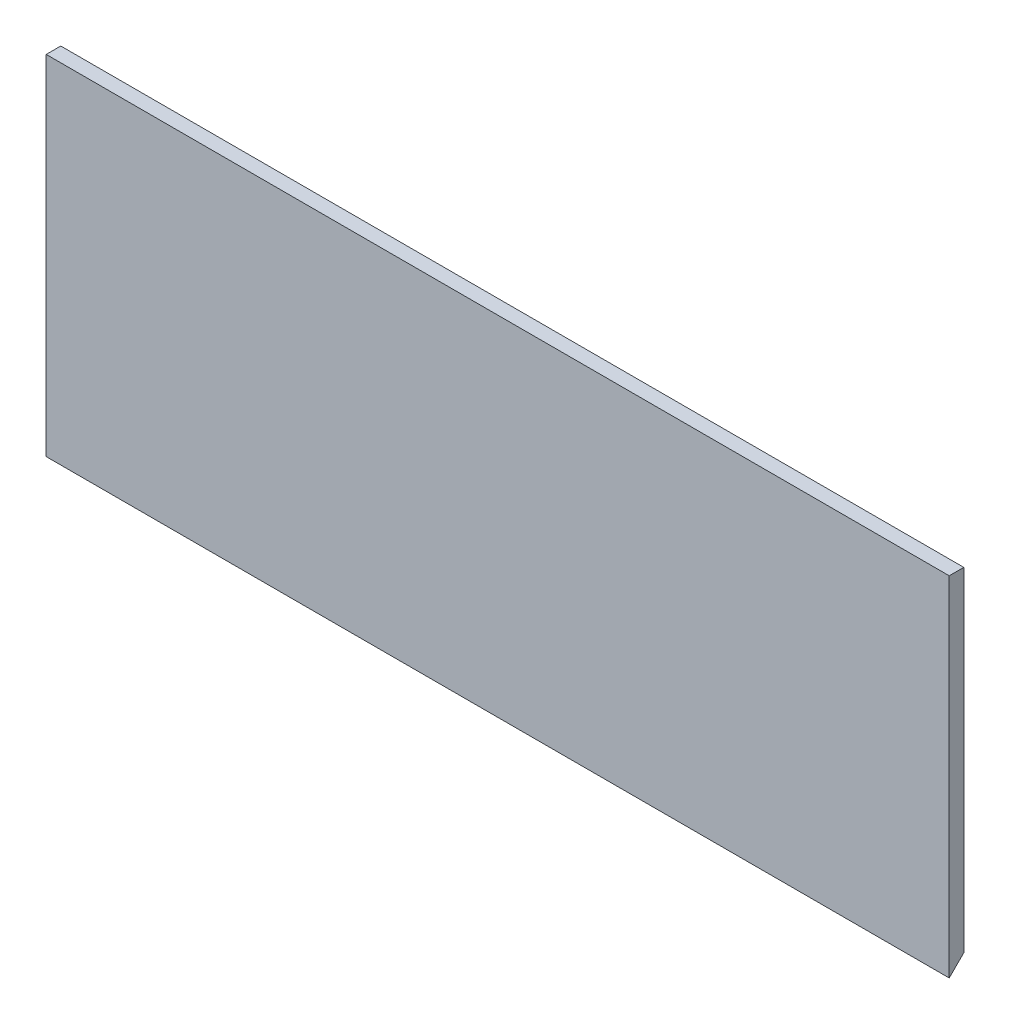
from build123d import *

# Parameters (mm, degrees)
SKETCH1_W      = 1181.1
SKETCH1_H      = 455.6125
EXTRUDE1_DEPTH = 9.525
EXTRUDE2_DEPTH = 1203.90632352


with BuildPart() as part:
    # Sketch1 → Extrude1 (new, symmetric)
    with BuildSketch(Plane.XY):
        Rectangle(SKETCH1_W, SKETCH1_H)
    extrude(amount=EXTRUDE1_DEPTH, both=True)

    # Sketch2 → Extrude2 (cut, through all)
    with BuildSketch(Plane(origin=(590.55, 0, 0), x_dir=(0, 0, -1), z_dir=(1, 0, 0))):
        Polygon((9.525, -208.75625), (-9.525, -227.80625), (9.525, -227.80625), align=None)
    extrude(amount=-EXTRUDE2_DEPTH, mode=Mode.SUBTRACT)


solid = part.part
